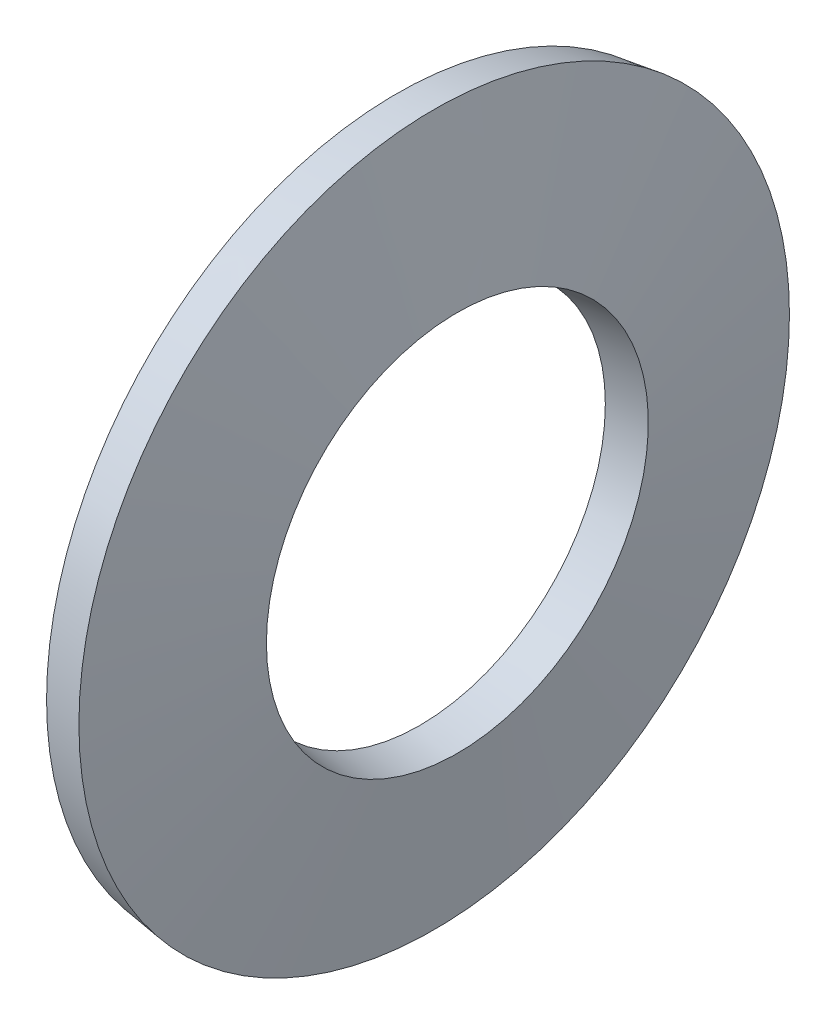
ISO-10303-21;
HEADER;
FILE_DESCRIPTION(('STEP AP214'),'2;1');
FILE_NAME('part.step','',(''),(''),'','','');
FILE_SCHEMA(('AUTOMOTIVE_DESIGN { 1 0 10303 214 1 1 1 1 }'));
ENDSEC;
DATA;
#1=APPLICATION_CONTEXT('core data for automotive mechanical design processes');
#2=APPLICATION_PROTOCOL_DEFINITION('international standard','automotive_design',2000,#1);
#3=PRODUCT_CONTEXT('',#1,'mechanical');
#4=PRODUCT('Part','Part','',(#3));
#5=PRODUCT_RELATED_PRODUCT_CATEGORY('part','',(#4));
#6=PRODUCT_DEFINITION_FORMATION('','',#4);
#7=PRODUCT_DEFINITION_CONTEXT('part definition',#1,'design');
#8=PRODUCT_DEFINITION('design','',#6,#7);
#9=PRODUCT_DEFINITION_SHAPE('','',#8);
#10=(LENGTH_UNIT() NAMED_UNIT(*) SI_UNIT(.MILLI.,.METRE.));
#11=(NAMED_UNIT(*) PLANE_ANGLE_UNIT() SI_UNIT($,.RADIAN.));
#12=(NAMED_UNIT(*) SI_UNIT($,.STERADIAN.) SOLID_ANGLE_UNIT());
#13=UNCERTAINTY_MEASURE_WITH_UNIT(LENGTH_MEASURE(1.E-05),#10,'distance_accuracy_value','');
#14=(GEOMETRIC_REPRESENTATION_CONTEXT(3) GLOBAL_UNCERTAINTY_ASSIGNED_CONTEXT((#13)) GLOBAL_UNIT_ASSIGNED_CONTEXT((#10,
#11,#12)) REPRESENTATION_CONTEXT('',''));
#15=CARTESIAN_POINT('',(0.,0.,0.));
#16=DIRECTION('',(0.,0.,1.));
#17=DIRECTION('',(1.,0.,0.));
#18=AXIS2_PLACEMENT_3D('',#15,#16,#17);
#19=CARTESIAN_POINT('',(1.2377290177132,0.,0.));
#20=DIRECTION('',(1.,0.,0.));
#21=DIRECTION('',(0.,0.,-1.));
#22=AXIS2_PLACEMENT_3D('',#19,#20,#21);
#23=CONICAL_SURFACE('',#22,11.6747194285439,0.140234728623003);
#24=CARTESIAN_POINT('',(0.,0.,0.));
#25=DIRECTION('',(-1.,0.,0.));
#26=DIRECTION('',(0.,0.,1.));
#27=AXIS2_PLACEMENT_3D('',#24,#25,#26);
#28=CIRCLE('',#27,11.5);
#29=CARTESIAN_POINT('',(0.,0.,11.5));
#30=VERTEX_POINT('',#29);
#31=EDGE_CURVE('E36',#30,#30,#28,.T.);
#32=ORIENTED_EDGE('',*,*,#31,.F.);
#33=EDGE_LOOP('',(#32));
#34=FACE_BOUND('',#33,.T.);
#35=CARTESIAN_POINT('',(1.2377290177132,0.,0.));
#36=DIRECTION('',(-1.,0.,0.));
#37=DIRECTION('',(0.,0.,1.));
#38=AXIS2_PLACEMENT_3D('',#35,#36,#37);
#39=CIRCLE('',#38,11.6747194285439);
#40=CARTESIAN_POINT('',(1.2377290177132,0.,11.6747194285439));
#41=VERTEX_POINT('',#40);
#42=EDGE_CURVE('E10',#41,#41,#39,.T.);
#43=ORIENTED_EDGE('',*,*,#42,.T.);
#44=EDGE_LOOP('',(#43));
#45=FACE_BOUND('',#44,.T.);
#46=ADVANCED_FACE('F22',(#34,#45),#23,.T.);
#47=CARTESIAN_POINT('',(2.,0.,0.));
#48=DIRECTION('',(-1.,0.,0.));
#49=DIRECTION('',(0.,0.,1.));
#50=AXIS2_PLACEMENT_3D('',#47,#48,#49);
#51=CONICAL_SURFACE('',#50,6.27471942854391,1.43056159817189);
#52=ORIENTED_EDGE('',*,*,#42,.F.);
#53=EDGE_LOOP('',(#52));
#54=FACE_BOUND('',#53,.T.);
#55=CARTESIAN_POINT('',(2.,0.,0.));
#56=DIRECTION('',(-1.,0.,0.));
#57=DIRECTION('',(0.,0.,1.));
#58=AXIS2_PLACEMENT_3D('',#55,#56,#57);
#59=CIRCLE('',#58,6.27471942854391);
#60=CARTESIAN_POINT('',(2.,0.,6.27471942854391));
#61=VERTEX_POINT('',#60);
#62=EDGE_CURVE('E28',#61,#61,#59,.T.);
#63=ORIENTED_EDGE('',*,*,#62,.T.);
#64=EDGE_LOOP('',(#63));
#65=FACE_BOUND('',#64,.T.);
#66=ADVANCED_FACE('F45',(#54,#65),#51,.T.);
#67=CARTESIAN_POINT('',(0.762270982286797,0.,0.));
#68=DIRECTION('',(1.,0.,0.));
#69=DIRECTION('',(0.,0.,-1.));
#70=AXIS2_PLACEMENT_3D('',#67,#68,#69);
#71=CONICAL_SURFACE('',#70,6.1,0.140234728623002);
#72=ORIENTED_EDGE('',*,*,#62,.F.);
#73=EDGE_LOOP('',(#72));
#74=FACE_BOUND('',#73,.T.);
#75=CARTESIAN_POINT('',(0.762270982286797,0.,0.));
#76=DIRECTION('',(-1.,0.,0.));
#77=DIRECTION('',(0.,0.,1.));
#78=AXIS2_PLACEMENT_3D('',#75,#76,#77);
#79=CIRCLE('',#78,6.1);
#80=CARTESIAN_POINT('',(0.762270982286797,0.,6.1));
#81=VERTEX_POINT('',#80);
#82=EDGE_CURVE('E32',#81,#81,#79,.T.);
#83=ORIENTED_EDGE('',*,*,#82,.T.);
#84=EDGE_LOOP('',(#83));
#85=FACE_BOUND('',#84,.T.);
#86=ADVANCED_FACE('F49',(#74,#85),#71,.F.);
#87=CARTESIAN_POINT('',(0.,0.,0.));
#88=DIRECTION('',(-1.,0.,0.));
#89=DIRECTION('',(0.,0.,1.));
#90=AXIS2_PLACEMENT_3D('',#87,#88,#89);
#91=CONICAL_SURFACE('',#90,11.5,1.43056159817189);
#92=ORIENTED_EDGE('',*,*,#82,.F.);
#93=EDGE_LOOP('',(#92));
#94=FACE_BOUND('',#93,.T.);
#95=ORIENTED_EDGE('',*,*,#31,.T.);
#96=EDGE_LOOP('',(#95));
#97=FACE_BOUND('',#96,.T.);
#98=ADVANCED_FACE('F42',(#94,#97),#91,.F.);
#99=CLOSED_SHELL('',(#46,#66,#86,#98));
#100=MANIFOLD_SOLID_BREP('B2',#99);
#101=ADVANCED_BREP_SHAPE_REPRESENTATION('',(#18,#100),#14);
#102=SHAPE_DEFINITION_REPRESENTATION(#9,#101);
ENDSEC;
END-ISO-10303-21;
